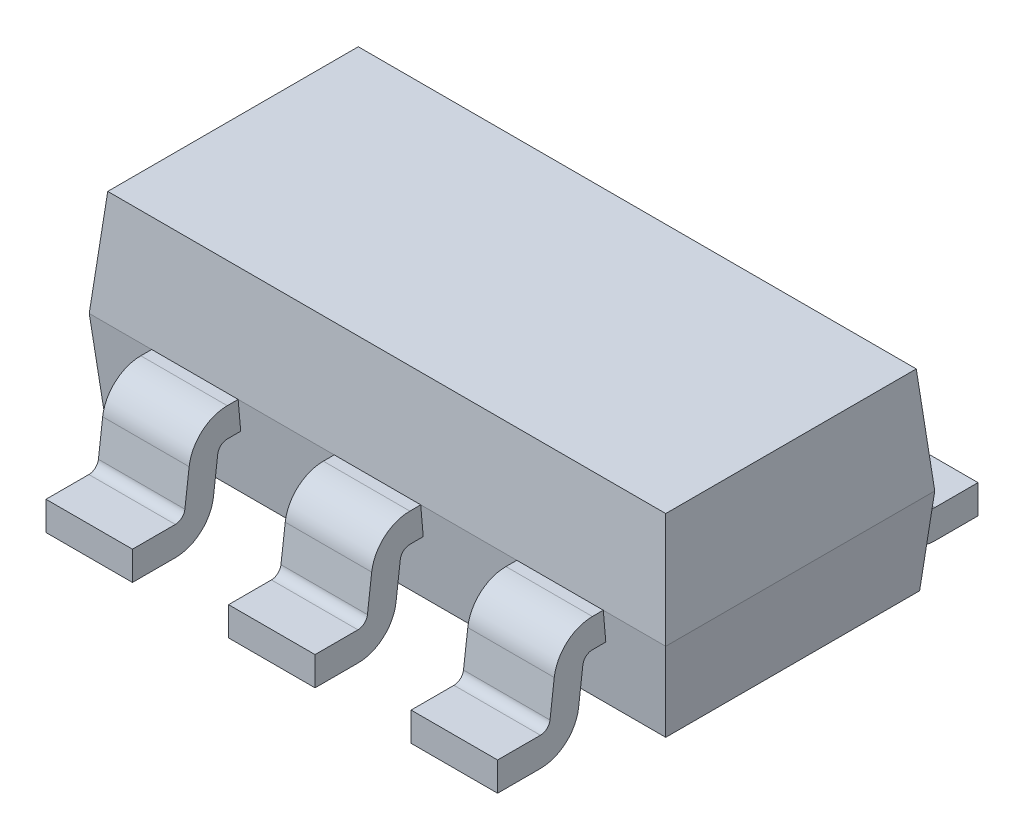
from build123d import *

# Parameters (mm, degrees)
SKETCH1_W                = 3
SKETCH1_H                = 1.4
EXTRUDE1_DEPTH           = 0.55
EXTRUDE1_TAPER           = 5
EXTRUDE1_OTHER_WAY_DEPTH = 0.45
EXTRUDE1_OTHER_WAY_TAPER = 5
EXTRUDE2_DEPTH           = 0.225
EXTRUDE2_DEPTH_BACK      = 0.225
EXTRUDE3_START           = 0.95
EXTRUDE3_DEPTH           = 0.225
MIRROR_START             = 0.95
MIRROR_1_COPY_1_DEPTH    = 0.225
FILLET1_R                = 0.05
FILLET2_R                = 0.2


with BuildPart() as part:
    # Sketch1 → Extrude1 (new body)
    with BuildSketch(Plane(origin=(0, 0, 0), x_dir=(1, 0, 0), z_dir=(0, 1, 0))):
        Rectangle(SKETCH1_W, SKETCH1_H)
    extrude(amount=EXTRUDE1_DEPTH, taper=EXTRUDE1_TAPER)

    # Sketch1 → Extrude1 other way (add)
    with BuildSketch(Plane(origin=(0, 0, 0), x_dir=(1, 0, 0), z_dir=(0, 1, 0))):
        Rectangle(SKETCH1_W, SKETCH1_H)
    extrude(amount=-EXTRUDE1_OTHER_WAY_DEPTH, taper=EXTRUDE1_OTHER_WAY_TAPER)

    # Sketch2 → Extrude2 (add, two sides: drawn at the far end of the back side and taken through both)
    with BuildSketch(Plane(origin=(0, 0, 0), x_dir=(0, 0, -1), z_dir=(1, 0, 0)).offset(-EXTRUDE2_DEPTH_BACK)):
        Polygon((-0.585273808, 0), (-0.933594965, 0), (-0.98270879, -0.4), (-1.25, -0.4), (-1.25, -0.55), (-0.85, -0.55), (-0.800886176, -0.15), (-0.585273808, -0.15), align=None)
    extrude(amount=EXTRUDE2_DEPTH + EXTRUDE2_DEPTH_BACK)

    # Sketch2_3 → Extrude3 (add, symmetric)
    with BuildSketch(Plane(origin=(0, 0, 0), x_dir=(0, 0, -1), z_dir=(1, 0, 0)).offset(EXTRUDE3_START)):
        Polygon((0.585273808, 0), (0.933594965, 0), (0.98270879, -0.4), (1.25, -0.4), (1.25, -0.55), (0.85, -0.55), (0.800886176, -0.15), (0.585273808, -0.15), align=None)
    extrude3 = extrude(amount=EXTRUDE3_DEPTH, both=True)

    # Mirror1: Extrude3 across plane
    add(extrude3.mirror(Plane(origin=(0, 0, 0), x_dir=(0, 0, 1), z_dir=(1, 0, 0))))

    # Mirror 1: Extrude3 across plane
    add(extrude3.mirror(Plane.XY))

    # Mirror 1 copy 1 sketch → Mirror 1 copy 1 (add, symmetric)
    with BuildSketch(Plane.ZY.offset(MIRROR_START)):
        Polygon((0.585273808, 0), (0.933594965, 0), (0.98270879, -0.4), (1.25, -0.4), (1.25, -0.55), (0.85, -0.55), (0.800886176, -0.15), (0.585273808, -0.15), align=None)
    extrude(amount=MIRROR_1_COPY_1_DEPTH, both=True)

    # Fillet1
    fillet1_edges = [part.edges().sort_by_distance(p)[0] for p in [
        (0.95, -0.4, 0.98270879),
        (0.95, -0.15, 0.800886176),
        (-0.95, -0.15, 0.800886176),
        (-0.95, -0.4, 0.98270879),
        (0, -0.4, 0.98270879),
        (0, -0.15, 0.800886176),
        (0.95, -0.15, -0.800886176),
        (0.95, -0.4, -0.98270879),
        (-0.95, -0.4, -0.98270879),
        (-0.95, -0.15, -0.800886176),
    ]]
    fillet(fillet1_edges, radius=FILLET1_R)

    # Fillet2
    fillet2_edges = [part.edges().sort_by_distance(p)[0] for p in [
        (0.95, 0, 0.933594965),
        (0.95, -0.55, 0.85),
        (-0.95, 0, 0.933594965),
        (-0.95, -0.55, 0.85),
        (0, 0, 0.933594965),
        (0, -0.55, 0.85),
        (0.95, 0, -0.933594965),
        (0.95, -0.55, -0.85),
        (-0.95, 0, -0.933594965),
        (-0.95, -0.55, -0.85),
    ]]
    fillet(fillet2_edges, radius=FILLET2_R)


solid = part.part
